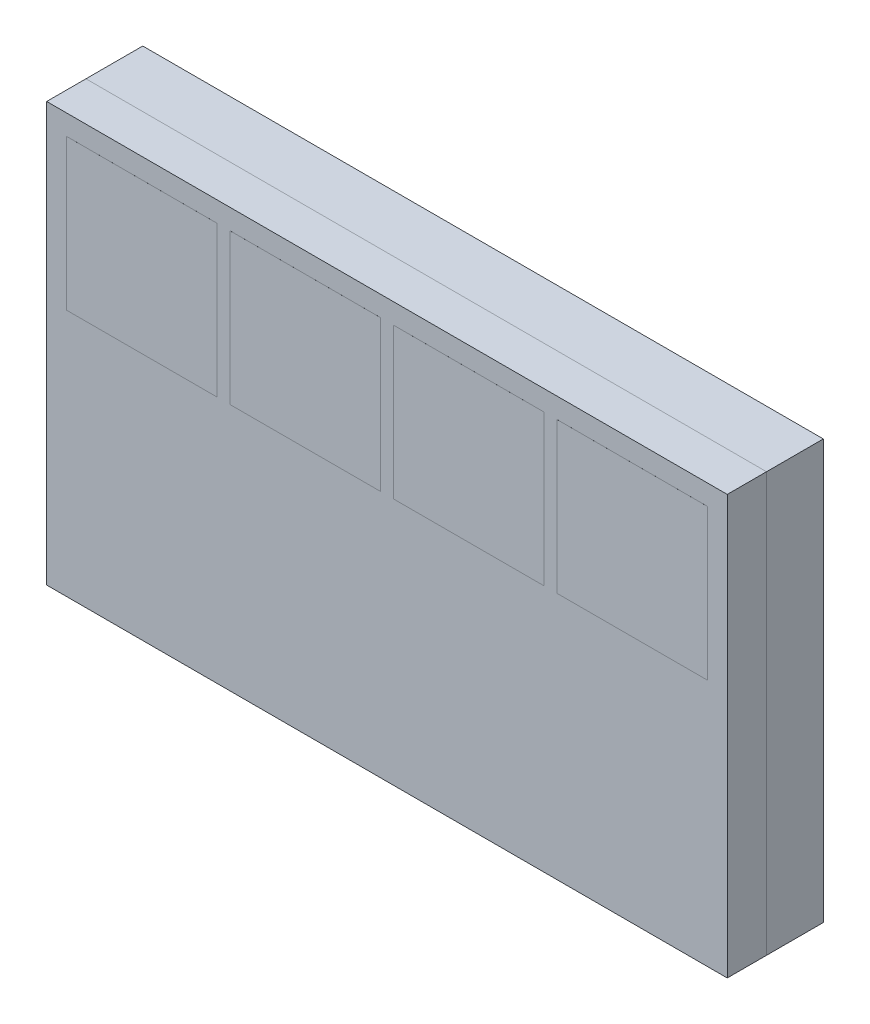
from build123d import *

# Parameters (mm, degrees)
SKETCH_1_W      = 5.2
SKETCH_1_H      = 3.2
EXTRUDE_1_DEPTH = 0.3
SKETCH_2_W      = 1.15
SKETCH_2_H      = 1.15
EXTRUDE_2_DEPTH = 0.0001
SKETCH_3_W      = 5.2
SKETCH_3_H      = 3.2
EXTRUDE_3_DEPTH = 0.434
EXTRUDE_4_DEPTH = 0.056


with BuildPart() as part:
    # Sketch 1 → Extrude 1 (new body)
    with BuildSketch(Plane.XY):
        with Locations((0, -0.87)):
            Rectangle(SKETCH_1_W, SKETCH_1_H)
    extrude(amount=-EXTRUDE_1_DEPTH)

    # Sketch 2 → Extrude 2 (add)
    with BuildSketch(Plane.XY):
        with Locations((-1.875, 0)):
            Rectangle(SKETCH_2_W, SKETCH_2_H)
        with Locations((-0.625, 0)):
            Rectangle(SKETCH_2_W, SKETCH_2_H)
        with Locations((0.625, 0)):
            Rectangle(SKETCH_2_W, SKETCH_2_H)
        with Locations((1.875, 0)):
            Rectangle(SKETCH_2_W, SKETCH_2_H)
    extrude(amount=EXTRUDE_2_DEPTH)


with BuildPart() as body_2:
    # Sketch 3 → Extrude 3 (new body)
    with BuildSketch(Plane(origin=(0, 0, -0.3), x_dir=(-1, 0, 0), z_dir=(0, 0, -1))):
        with Locations((0, -0.87)):
            Rectangle(SKETCH_3_W, SKETCH_3_H)
    extrude(amount=EXTRUDE_3_DEPTH)

    # Sketch 4 → Extrude 4 (add)
    with BuildSketch(Plane(origin=(0, 0, -0.734), x_dir=(-1, 0, 0), z_dir=(0, 0, -1))):
        with BuildLine():
            Line((-1.9, 0.55), (-0.5, 0.55))
            ThreePointArc((-0.5, 0.55), (-0.287867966, 0.462132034), (-0.2, 0.25))
            Line((-0.2, 0.25), (-0.2, -0.37))
            ThreePointArc((-0.2, -0.37), (-0.287867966, -0.582132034), (-0.5, -0.67))
            Line((-0.5, -0.67), (-1.9, -0.67))
            ThreePointArc((-1.9, -0.67), (-2.112132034, -0.582132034), (-2.2, -0.37))
            Line((-2.2, -0.37), (-2.2, 0.25))
            ThreePointArc((-2.2, 0.25), (-2.112132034, 0.462132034), (-1.9, 0.55))
        make_face()
        with BuildLine():
            Line((0.2, 0.25), (0.2, -0.37))
            ThreePointArc((0.2, -0.37), (0.287867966, -0.582132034), (0.5, -0.67))
            Line((0.5, -0.67), (1.9, -0.67))
            ThreePointArc((1.9, -0.67), (2.112132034, -0.582132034), (2.2, -0.37))
            Line((2.2, -0.37), (2.2, 0.25))
            ThreePointArc((2.2, 0.25), (2.112132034, 0.462132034), (1.9, 0.55))
            Line((1.9, 0.55), (0.5, 0.55))
            ThreePointArc((0.5, 0.55), (0.287867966, 0.462132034), (0.2, 0.25))
        make_face()
        with BuildLine():
            Line((0.2, -1.47), (0.2, -1.99))
            ThreePointArc((0.2, -1.99), (0.287867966, -2.202132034), (0.5, -2.29))
            Line((0.5, -2.29), (1.9, -2.29))
            ThreePointArc((1.9, -2.29), (2.112132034, -2.202132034), (2.2, -1.99))
            Line((2.2, -1.99), (2.2, -1.37))
            ThreePointArc((2.2, -1.37), (2.112132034, -1.157867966), (1.9, -1.07))
            Line((1.9, -1.07), (0.6, -1.07))
            Line((0.6, -1.07), (0.2, -1.47))
        make_face()
        with BuildLine():
            Line((-2.2, -1.37), (-2.2, -1.99))
            ThreePointArc((-2.2, -1.99), (-2.112132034, -2.202132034), (-1.9, -2.29))
            Line((-1.9, -2.29), (-0.5, -2.29))
            ThreePointArc((-0.5, -2.29), (-0.287867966, -2.202132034), (-0.2, -1.99))
            Line((-0.2, -1.99), (-0.2, -1.37))
            ThreePointArc((-0.2, -1.37), (-0.287867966, -1.157867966), (-0.5, -1.07))
            Line((-0.5, -1.07), (-1.9, -1.07))
            ThreePointArc((-1.9, -1.07), (-2.112132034, -1.157867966), (-2.2, -1.37))
        make_face()
    extrude(amount=EXTRUDE_4_DEPTH)


solid = Compound([part.part, body_2.part])
